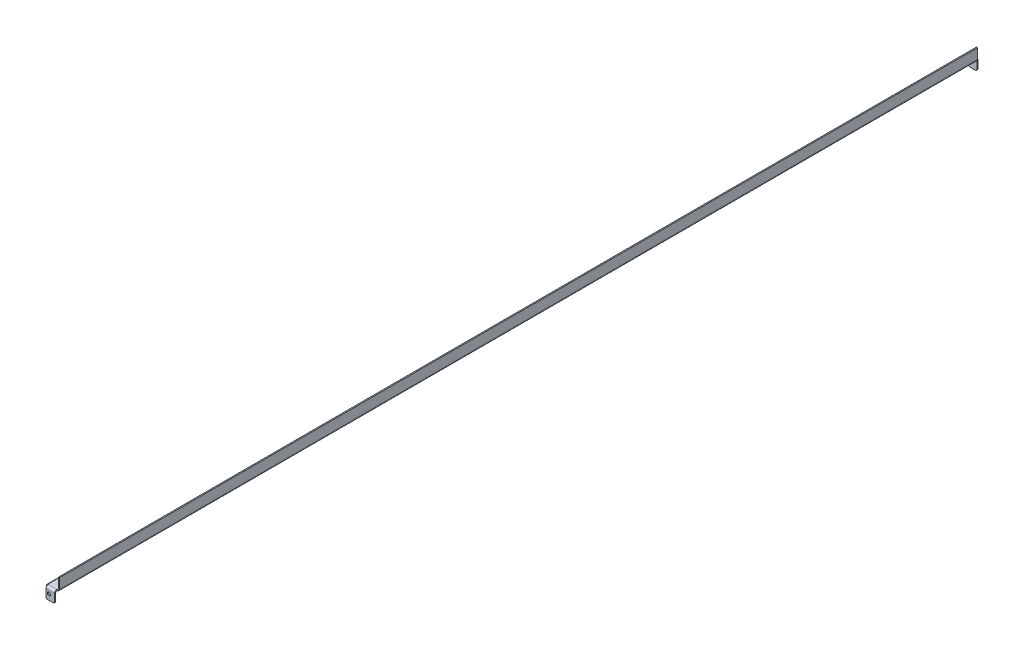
ISO-10303-21;
HEADER;
FILE_DESCRIPTION(('STEP AP214'),'2;1');
FILE_NAME('part.step','',(''),(''),'','','');
FILE_SCHEMA(('AUTOMOTIVE_DESIGN { 1 0 10303 214 1 1 1 1 }'));
ENDSEC;
DATA;
#1=APPLICATION_CONTEXT('core data for automotive mechanical design processes');
#2=APPLICATION_PROTOCOL_DEFINITION('international standard','automotive_design',2000,#1);
#3=PRODUCT_CONTEXT('',#1,'mechanical');
#4=PRODUCT('Part','Part','',(#3));
#5=PRODUCT_RELATED_PRODUCT_CATEGORY('part','',(#4));
#6=PRODUCT_DEFINITION_FORMATION('','',#4);
#7=PRODUCT_DEFINITION_CONTEXT('part definition',#1,'design');
#8=PRODUCT_DEFINITION('design','',#6,#7);
#9=PRODUCT_DEFINITION_SHAPE('','',#8);
#10=(LENGTH_UNIT() NAMED_UNIT(*) SI_UNIT(.MILLI.,.METRE.));
#11=(NAMED_UNIT(*) PLANE_ANGLE_UNIT() SI_UNIT($,.RADIAN.));
#12=(NAMED_UNIT(*) SI_UNIT($,.STERADIAN.) SOLID_ANGLE_UNIT());
#13=UNCERTAINTY_MEASURE_WITH_UNIT(LENGTH_MEASURE(1.E-05),#10,'distance_accuracy_value','');
#14=(GEOMETRIC_REPRESENTATION_CONTEXT(3) GLOBAL_UNCERTAINTY_ASSIGNED_CONTEXT((#13)) GLOBAL_UNIT_ASSIGNED_CONTEXT((#10,
#11,#12)) REPRESENTATION_CONTEXT('',''));
#15=CARTESIAN_POINT('',(0.,0.,0.));
#16=DIRECTION('',(0.,0.,1.));
#17=DIRECTION('',(1.,0.,0.));
#18=AXIS2_PLACEMENT_3D('',#15,#16,#17);
#19=CARTESIAN_POINT('',(6.,20.,2475.));
#20=DIRECTION('',(0.,0.,1.));
#21=DIRECTION('',(1.,0.,0.));
#22=AXIS2_PLACEMENT_3D('',#19,#20,#21);
#23=PLANE('',#22);
#24=DIRECTION('',(0.,-1.,0.));
#25=VECTOR('',#24,1.);
#26=CARTESIAN_POINT('',(6.,20.,2475.));
#27=LINE('',#26,#25);
#28=CARTESIAN_POINT('',(6.,20.,2475.));
#29=VERTEX_POINT('',#28);
#30=CARTESIAN_POINT('',(6.,17.,2475.));
#31=VERTEX_POINT('',#30);
#32=EDGE_CURVE('E502',#29,#31,#27,.T.);
#33=ORIENTED_EDGE('',*,*,#32,.F.);
#34=CARTESIAN_POINT('',(6.,14.,2475.));
#35=DIRECTION('',(0.,0.,1.));
#36=DIRECTION('',(1.,0.,0.));
#37=AXIS2_PLACEMENT_3D('',#34,#35,#36);
#38=CIRCLE('',#37,6.);
#39=CARTESIAN_POINT('',(0.,14.,2475.));
#40=VERTEX_POINT('',#39);
#41=EDGE_CURVE('E410',#40,#29,#38,.F.);
#42=ORIENTED_EDGE('',*,*,#41,.F.);
#43=DIRECTION('',(-1.,0.,0.));
#44=VECTOR('',#43,1.);
#45=CARTESIAN_POINT('',(3.,14.,2475.));
#46=LINE('',#45,#44);
#47=CARTESIAN_POINT('',(3.,14.,2475.));
#48=VERTEX_POINT('',#47);
#49=EDGE_CURVE('E500',#48,#40,#46,.T.);
#50=ORIENTED_EDGE('',*,*,#49,.F.);
#51=CARTESIAN_POINT('',(6.,14.,2475.));
#52=DIRECTION('',(0.,0.,1.));
#53=DIRECTION('',(1.,0.,0.));
#54=AXIS2_PLACEMENT_3D('',#51,#52,#53);
#55=CIRCLE('',#54,3.);
#56=EDGE_CURVE('E422',#48,#31,#55,.F.);
#57=ORIENTED_EDGE('',*,*,#56,.T.);
#58=EDGE_LOOP('',(#33,#42,#50,#57));
#59=FACE_BOUND('',#58,.T.);
#60=ADVANCED_FACE('F76',(#59),#23,.T.);
#61=CARTESIAN_POINT('',(0.,14.,0.));
#62=DIRECTION('',(0.,0.,-1.));
#63=DIRECTION('',(-1.,0.,0.));
#64=AXIS2_PLACEMENT_3D('',#61,#62,#63);
#65=PLANE('',#64);
#66=DIRECTION('',(1.,0.,0.));
#67=VECTOR('',#66,1.);
#68=CARTESIAN_POINT('',(0.,14.,0.));
#69=LINE('',#68,#67);
#70=CARTESIAN_POINT('',(0.,14.,0.));
#71=VERTEX_POINT('',#70);
#72=CARTESIAN_POINT('',(3.,14.,0.));
#73=VERTEX_POINT('',#72);
#74=EDGE_CURVE('E498',#71,#73,#69,.T.);
#75=ORIENTED_EDGE('',*,*,#74,.F.);
#76=CARTESIAN_POINT('',(6.,14.,0.));
#77=DIRECTION('',(0.,0.,1.));
#78=DIRECTION('',(1.,0.,0.));
#79=AXIS2_PLACEMENT_3D('',#76,#77,#78);
#80=CIRCLE('',#79,6.);
#81=CARTESIAN_POINT('',(6.,20.,0.));
#82=VERTEX_POINT('',#81);
#83=EDGE_CURVE('E439',#71,#82,#80,.F.);
#84=ORIENTED_EDGE('',*,*,#83,.T.);
#85=DIRECTION('',(0.,1.,0.));
#86=VECTOR('',#85,1.);
#87=CARTESIAN_POINT('',(6.,17.,0.));
#88=LINE('',#87,#86);
#89=CARTESIAN_POINT('',(6.,17.,0.));
#90=VERTEX_POINT('',#89);
#91=EDGE_CURVE('E495',#90,#82,#88,.T.);
#92=ORIENTED_EDGE('',*,*,#91,.F.);
#93=CARTESIAN_POINT('',(6.,14.,0.));
#94=DIRECTION('',(0.,0.,1.));
#95=DIRECTION('',(1.,0.,0.));
#96=AXIS2_PLACEMENT_3D('',#93,#94,#95);
#97=CIRCLE('',#96,3.);
#98=EDGE_CURVE('E450',#73,#90,#97,.F.);
#99=ORIENTED_EDGE('',*,*,#98,.F.);
#100=EDGE_LOOP('',(#75,#84,#92,#99));
#101=FACE_BOUND('',#100,.T.);
#102=ADVANCED_FACE('F634',(#101),#65,.T.);
#103=CARTESIAN_POINT('',(6.,17.,0.));
#104=DIRECTION('',(0.,0.,-1.));
#105=DIRECTION('',(-1.,0.,0.));
#106=AXIS2_PLACEMENT_3D('',#103,#104,#105);
#107=PLANE('',#106);
#108=DIRECTION('',(0.,1.,0.));
#109=VECTOR('',#108,1.);
#110=CARTESIAN_POINT('',(0.,0.,0.));
#111=LINE('',#110,#109);
#112=CARTESIAN_POINT('',(0.,0.,0.));
#113=VERTEX_POINT('',#112);
#114=EDGE_CURVE('E441',#113,#71,#111,.T.);
#115=ORIENTED_EDGE('',*,*,#114,.T.);
#116=ORIENTED_EDGE('',*,*,#74,.T.);
#117=DIRECTION('',(0.,1.,0.));
#118=VECTOR('',#117,1.);
#119=CARTESIAN_POINT('',(3.,0.,0.));
#120=LINE('',#119,#118);
#121=CARTESIAN_POINT('',(3.,0.,0.));
#122=VERTEX_POINT('',#121);
#123=EDGE_CURVE('E447',#122,#73,#120,.T.);
#124=ORIENTED_EDGE('',*,*,#123,.F.);
#125=DIRECTION('',(-1.,0.,0.));
#126=VECTOR('',#125,1.);
#127=CARTESIAN_POINT('',(3.,0.,0.));
#128=LINE('',#127,#126);
#129=EDGE_CURVE('E444',#122,#113,#128,.T.);
#130=ORIENTED_EDGE('',*,*,#129,.T.);
#131=EDGE_LOOP('',(#115,#116,#124,#130));
#132=FACE_BOUND('',#131,.T.);
#133=ADVANCED_FACE('F640',(#132),#107,.T.);
#134=CARTESIAN_POINT('',(32.22,23.,2475.));
#135=DIRECTION('',(0.,0.,1.));
#136=DIRECTION('',(1.,0.,0.));
#137=AXIS2_PLACEMENT_3D('',#134,#135,#136);
#138=PLANE('',#137);
#139=DIRECTION('',(1.,0.,0.));
#140=VECTOR('',#139,1.);
#141=CARTESIAN_POINT('',(32.22,23.,2475.));
#142=LINE('',#141,#140);
#143=CARTESIAN_POINT('',(32.22,23.,2475.));
#144=VERTEX_POINT('',#143);
#145=CARTESIAN_POINT('',(35.22,23.,2475.));
#146=VERTEX_POINT('',#145);
#147=EDGE_CURVE('E493',#144,#146,#142,.T.);
#148=ORIENTED_EDGE('',*,*,#147,.F.);
#149=CARTESIAN_POINT('',(29.22,23.,2475.));
#150=DIRECTION('',(0.,0.,-1.));
#151=DIRECTION('',(-1.,0.,0.));
#152=AXIS2_PLACEMENT_3D('',#149,#150,#151);
#153=CIRCLE('',#152,3.);
#154=CARTESIAN_POINT('',(29.22,19.9999999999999,2475.));
#155=VERTEX_POINT('',#154);
#156=EDGE_CURVE('E407',#155,#144,#153,.F.);
#157=ORIENTED_EDGE('',*,*,#156,.F.);
#158=DIRECTION('',(0.,1.,0.));
#159=VECTOR('',#158,1.);
#160=CARTESIAN_POINT('',(29.22,17.,2475.));
#161=LINE('',#160,#159);
#162=CARTESIAN_POINT('',(29.22,17.,2475.));
#163=VERTEX_POINT('',#162);
#164=EDGE_CURVE('E490',#163,#155,#161,.T.);
#165=ORIENTED_EDGE('',*,*,#164,.F.);
#166=CARTESIAN_POINT('',(29.22,23.,2475.));
#167=DIRECTION('',(0.,0.,1.));
#168=DIRECTION('',(1.,0.,0.));
#169=AXIS2_PLACEMENT_3D('',#166,#167,#168);
#170=CIRCLE('',#169,6.);
#171=EDGE_CURVE('E424',#163,#146,#170,.T.);
#172=ORIENTED_EDGE('',*,*,#171,.T.);
#173=EDGE_LOOP('',(#148,#157,#165,#172));
#174=FACE_BOUND('',#173,.T.);
#175=ADVANCED_FACE('F787',(#174),#138,.T.);
#176=CARTESIAN_POINT('',(29.22,17.,2475.));
#177=DIRECTION('',(0.,0.,1.));
#178=DIRECTION('',(1.,0.,0.));
#179=AXIS2_PLACEMENT_3D('',#176,#177,#178);
#180=PLANE('',#179);
#181=DIRECTION('',(0.,1.,0.));
#182=VECTOR('',#181,1.);
#183=CARTESIAN_POINT('',(32.22,20.,2475.));
#184=LINE('',#183,#182);
#185=CARTESIAN_POINT('',(32.22,50.,2475.));
#186=VERTEX_POINT('',#185);
#187=EDGE_CURVE('E404',#144,#186,#184,.T.);
#188=ORIENTED_EDGE('',*,*,#187,.F.);
#189=ORIENTED_EDGE('',*,*,#147,.T.);
#190=DIRECTION('',(0.,1.,0.));
#191=VECTOR('',#190,1.);
#192=CARTESIAN_POINT('',(35.22,20.,2475.));
#193=LINE('',#192,#191);
#194=CARTESIAN_POINT('',(35.22,50.,2475.));
#195=VERTEX_POINT('',#194);
#196=EDGE_CURVE('E398',#146,#195,#193,.T.);
#197=ORIENTED_EDGE('',*,*,#196,.T.);
#198=DIRECTION('',(1.,0.,0.));
#199=VECTOR('',#198,1.);
#200=CARTESIAN_POINT('',(32.22,50.,2475.));
#201=LINE('',#200,#199);
#202=EDGE_CURVE('E400',#186,#195,#201,.T.);
#203=ORIENTED_EDGE('',*,*,#202,.F.);
#204=EDGE_LOOP('',(#188,#189,#197,#203));
#205=FACE_BOUND('',#204,.T.);
#206=ADVANCED_FACE('F783',(#205),#180,.T.);
#207=CARTESIAN_POINT('',(29.22,20.,0.));
#208=DIRECTION('',(0.,0.,-1.));
#209=DIRECTION('',(-1.,0.,0.));
#210=AXIS2_PLACEMENT_3D('',#207,#208,#209);
#211=PLANE('',#210);
#212=DIRECTION('',(0.,-1.,0.));
#213=VECTOR('',#212,1.);
#214=CARTESIAN_POINT('',(29.22,20.,0.));
#215=LINE('',#214,#213);
#216=CARTESIAN_POINT('',(29.22,20.,0.));
#217=VERTEX_POINT('',#216);
#218=CARTESIAN_POINT('',(29.22,17.,0.));
#219=VERTEX_POINT('',#218);
#220=EDGE_CURVE('E487',#217,#219,#215,.T.);
#221=ORIENTED_EDGE('',*,*,#220,.F.);
#222=CARTESIAN_POINT('',(29.22,23.,0.));
#223=DIRECTION('',(0.,0.,-1.));
#224=DIRECTION('',(-1.,0.,0.));
#225=AXIS2_PLACEMENT_3D('',#222,#223,#224);
#226=CIRCLE('',#225,3.);
#227=CARTESIAN_POINT('',(32.22,23.,0.));
#228=VERTEX_POINT('',#227);
#229=EDGE_CURVE('E436',#217,#228,#226,.F.);
#230=ORIENTED_EDGE('',*,*,#229,.T.);
#231=DIRECTION('',(-1.,0.,0.));
#232=VECTOR('',#231,1.);
#233=CARTESIAN_POINT('',(35.22,23.,0.));
#234=LINE('',#233,#232);
#235=CARTESIAN_POINT('',(35.22,23.,0.));
#236=VERTEX_POINT('',#235);
#237=EDGE_CURVE('E485',#236,#228,#234,.T.);
#238=ORIENTED_EDGE('',*,*,#237,.F.);
#239=CARTESIAN_POINT('',(29.22,23.,0.));
#240=DIRECTION('',(0.,0.,1.));
#241=DIRECTION('',(1.,0.,0.));
#242=AXIS2_PLACEMENT_3D('',#239,#240,#241);
#243=CIRCLE('',#242,6.);
#244=EDGE_CURVE('E401',#219,#236,#243,.T.);
#245=ORIENTED_EDGE('',*,*,#244,.F.);
#246=EDGE_LOOP('',(#221,#230,#238,#245));
#247=FACE_BOUND('',#246,.T.);
#248=ADVANCED_FACE('F779',(#247),#211,.T.);
#249=CARTESIAN_POINT('',(35.22,20.,2475.));
#250=DIRECTION('',(-1.,0.,0.));
#251=DIRECTION('',(0.,0.,1.));
#252=AXIS2_PLACEMENT_3D('',#249,#250,#251);
#253=PLANE('',#252);
#254=DIRECTION('',(0.,1.,0.));
#255=VECTOR('',#254,1.);
#256=CARTESIAN_POINT('',(35.22,20.,0.));
#257=LINE('',#256,#255);
#258=CARTESIAN_POINT('',(35.22,50.,0.));
#259=VERTEX_POINT('',#258);
#260=EDGE_CURVE('E395',#236,#259,#257,.T.);
#261=ORIENTED_EDGE('',*,*,#260,.T.);
#262=DIRECTION('',(0.,0.,-1.));
#263=VECTOR('',#262,1.);
#264=CARTESIAN_POINT('',(35.22,50.,2475.));
#265=LINE('',#264,#263);
#266=EDGE_CURVE('E483',#195,#259,#265,.T.);
#267=ORIENTED_EDGE('',*,*,#266,.F.);
#268=ORIENTED_EDGE('',*,*,#196,.F.);
#269=DIRECTION('',(0.,0.,-1.));
#270=VECTOR('',#269,1.);
#271=CARTESIAN_POINT('',(35.22,23.,2475.));
#272=LINE('',#271,#270);
#273=EDGE_CURVE('E427',#146,#236,#272,.T.);
#274=ORIENTED_EDGE('',*,*,#273,.T.);
#275=EDGE_LOOP('',(#261,#267,#268,#274));
#276=FACE_BOUND('',#275,.T.);
#277=ADVANCED_FACE('F775',(#276),#253,.F.);
#278=CARTESIAN_POINT('',(32.22,50.,2475.));
#279=DIRECTION('',(0.,1.,0.));
#280=DIRECTION('',(0.,0.,1.));
#281=AXIS2_PLACEMENT_3D('',#278,#279,#280);
#282=PLANE('',#281);
#283=DIRECTION('',(1.,0.,0.));
#284=VECTOR('',#283,1.);
#285=CARTESIAN_POINT('',(32.22,50.,0.));
#286=LINE('',#285,#284);
#287=CARTESIAN_POINT('',(32.22,50.,0.));
#288=VERTEX_POINT('',#287);
#289=EDGE_CURVE('E430',#288,#259,#286,.T.);
#290=ORIENTED_EDGE('',*,*,#289,.F.);
#291=DIRECTION('',(0.,0.,-1.));
#292=VECTOR('',#291,1.);
#293=CARTESIAN_POINT('',(32.22,50.,2475.));
#294=LINE('',#293,#292);
#295=EDGE_CURVE('E481',#186,#288,#294,.T.);
#296=ORIENTED_EDGE('',*,*,#295,.F.);
#297=ORIENTED_EDGE('',*,*,#202,.T.);
#298=ORIENTED_EDGE('',*,*,#266,.T.);
#299=EDGE_LOOP('',(#290,#296,#297,#298));
#300=FACE_BOUND('',#299,.T.);
#301=ADVANCED_FACE('F771',(#300),#282,.T.);
#302=CARTESIAN_POINT('',(32.22,20.,2475.));
#303=DIRECTION('',(-1.,0.,0.));
#304=DIRECTION('',(0.,0.,1.));
#305=AXIS2_PLACEMENT_3D('',#302,#303,#304);
#306=PLANE('',#305);
#307=DIRECTION('',(0.,1.,0.));
#308=VECTOR('',#307,1.);
#309=CARTESIAN_POINT('',(32.22,20.,0.));
#310=LINE('',#309,#308);
#311=EDGE_CURVE('E433',#228,#288,#310,.T.);
#312=ORIENTED_EDGE('',*,*,#311,.F.);
#313=DIRECTION('',(0.,0.,-1.));
#314=VECTOR('',#313,1.);
#315=CARTESIAN_POINT('',(32.22,23.,2475.));
#316=LINE('',#315,#314);
#317=EDGE_CURVE('E478',#144,#228,#316,.T.);
#318=ORIENTED_EDGE('',*,*,#317,.F.);
#319=ORIENTED_EDGE('',*,*,#187,.T.);
#320=ORIENTED_EDGE('',*,*,#295,.T.);
#321=EDGE_LOOP('',(#312,#318,#319,#320));
#322=FACE_BOUND('',#321,.T.);
#323=ADVANCED_FACE('F767',(#322),#306,.T.);
#324=CARTESIAN_POINT('',(29.22,23.,2475.));
#325=DIRECTION('',(0.,0.,-1.));
#326=DIRECTION('',(-1.,0.,0.));
#327=AXIS2_PLACEMENT_3D('',#324,#325,#326);
#328=CYLINDRICAL_SURFACE('',#327,3.);
#329=ORIENTED_EDGE('',*,*,#229,.F.);
#330=DIRECTION('',(0.,0.,-1.));
#331=VECTOR('',#330,1.);
#332=CARTESIAN_POINT('',(29.22,20.,2475.));
#333=LINE('',#332,#331);
#334=EDGE_CURVE('E475',#155,#217,#333,.T.);
#335=ORIENTED_EDGE('',*,*,#334,.F.);
#336=ORIENTED_EDGE('',*,*,#156,.T.);
#337=ORIENTED_EDGE('',*,*,#317,.T.);
#338=EDGE_LOOP('',(#329,#335,#336,#337));
#339=FACE_BOUND('',#338,.T.);
#340=ADVANCED_FACE('F764',(#339),#328,.F.);
#341=CARTESIAN_POINT('',(0.,20.,2475.));
#342=DIRECTION('',(0.,1.,0.));
#343=DIRECTION('',(0.,0.,1.));
#344=AXIS2_PLACEMENT_3D('',#341,#342,#343);
#345=PLANE('',#344);
#346=ORIENTED_EDGE('',*,*,#334,.T.);
#347=DIRECTION('',(0.,0.,1.));
#348=VECTOR('',#347,1.);
#349=CARTESIAN_POINT('',(29.22,20.,-0.999999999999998));
#350=LINE('',#349,#348);
#351=CARTESIAN_POINT('',(29.22,20.,-0.999999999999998));
#352=VERTEX_POINT('',#351);
#353=EDGE_CURVE('E327',#352,#217,#350,.T.);
#354=ORIENTED_EDGE('',*,*,#353,.F.);
#355=DIRECTION('',(1.,0.,0.));
#356=VECTOR('',#355,1.);
#357=CARTESIAN_POINT('',(29.22,20.,-0.999999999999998));
#358=LINE('',#357,#356);
#359=CARTESIAN_POINT('',(6.,20.,-0.999999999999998));
#360=VERTEX_POINT('',#359);
#361=EDGE_CURVE('E270',#352,#360,#358,.F.);
#362=ORIENTED_EDGE('',*,*,#361,.T.);
#363=DIRECTION('',(0.,0.,1.));
#364=VECTOR('',#363,1.);
#365=CARTESIAN_POINT('',(6.,20.,-0.999999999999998));
#366=LINE('',#365,#364);
#367=EDGE_CURVE('E324',#360,#82,#366,.T.);
#368=ORIENTED_EDGE('',*,*,#367,.T.);
#369=DIRECTION('',(0.,0.,-1.));
#370=VECTOR('',#369,1.);
#371=CARTESIAN_POINT('',(6.,20.,2475.));
#372=LINE('',#371,#370);
#373=EDGE_CURVE('E472',#29,#82,#372,.T.);
#374=ORIENTED_EDGE('',*,*,#373,.F.);
#375=DIRECTION('',(0.,0.,-1.));
#376=VECTOR('',#375,1.);
#377=CARTESIAN_POINT('',(6.,19.9999999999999,2476.));
#378=LINE('',#377,#376);
#379=CARTESIAN_POINT('',(6.,19.9999999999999,2476.));
#380=VERTEX_POINT('',#379);
#381=EDGE_CURVE('E389',#380,#29,#378,.T.);
#382=ORIENTED_EDGE('',*,*,#381,.F.);
#383=DIRECTION('',(-1.,0.,0.));
#384=VECTOR('',#383,1.);
#385=CARTESIAN_POINT('',(6.,19.9999999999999,2476.));
#386=LINE('',#385,#384);
#387=CARTESIAN_POINT('',(29.22,19.9999999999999,2476.));
#388=VERTEX_POINT('',#387);
#389=EDGE_CURVE('E363',#380,#388,#386,.F.);
#390=ORIENTED_EDGE('',*,*,#389,.T.);
#391=DIRECTION('',(0.,0.,-1.));
#392=VECTOR('',#391,1.);
#393=CARTESIAN_POINT('',(29.22,19.9999999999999,2476.));
#394=LINE('',#393,#392);
#395=EDGE_CURVE('E386',#388,#155,#394,.T.);
#396=ORIENTED_EDGE('',*,*,#395,.T.);
#397=EDGE_LOOP('',(#346,#354,#362,#368,#374,#382,#390,#396));
#398=FACE_BOUND('',#397,.T.);
#399=ADVANCED_FACE('F567',(#398),#345,.T.);
#400=CARTESIAN_POINT('',(6.,14.,2475.));
#401=DIRECTION('',(0.,0.,-1.));
#402=DIRECTION('',(-1.,0.,0.));
#403=AXIS2_PLACEMENT_3D('',#400,#401,#402);
#404=CYLINDRICAL_SURFACE('',#403,6.);
#405=ORIENTED_EDGE('',*,*,#83,.F.);
#406=DIRECTION('',(0.,0.,-1.));
#407=VECTOR('',#406,1.);
#408=CARTESIAN_POINT('',(0.,14.,2475.));
#409=LINE('',#408,#407);
#410=EDGE_CURVE('E469',#40,#71,#409,.T.);
#411=ORIENTED_EDGE('',*,*,#410,.F.);
#412=ORIENTED_EDGE('',*,*,#41,.T.);
#413=ORIENTED_EDGE('',*,*,#373,.T.);
#414=EDGE_LOOP('',(#405,#411,#412,#413));
#415=FACE_BOUND('',#414,.T.);
#416=ADVANCED_FACE('F757',(#415),#404,.T.);
#417=CARTESIAN_POINT('',(0.,0.,2475.));
#418=DIRECTION('',(-1.,0.,0.));
#419=DIRECTION('',(0.,0.,1.));
#420=AXIS2_PLACEMENT_3D('',#417,#418,#419);
#421=PLANE('',#420);
#422=ORIENTED_EDGE('',*,*,#114,.F.);
#423=DIRECTION('',(0.,0.,-1.));
#424=VECTOR('',#423,1.);
#425=CARTESIAN_POINT('',(0.,0.,2475.));
#426=LINE('',#425,#424);
#427=CARTESIAN_POINT('',(0.,0.,2475.));
#428=VERTEX_POINT('',#427);
#429=EDGE_CURVE('E467',#428,#113,#426,.T.);
#430=ORIENTED_EDGE('',*,*,#429,.F.);
#431=DIRECTION('',(0.,1.,0.));
#432=VECTOR('',#431,1.);
#433=CARTESIAN_POINT('',(0.,0.,2475.));
#434=LINE('',#433,#432);
#435=EDGE_CURVE('E413',#428,#40,#434,.T.);
#436=ORIENTED_EDGE('',*,*,#435,.T.);
#437=ORIENTED_EDGE('',*,*,#410,.T.);
#438=EDGE_LOOP('',(#422,#430,#436,#437));
#439=FACE_BOUND('',#438,.T.);
#440=ADVANCED_FACE('F753',(#439),#421,.T.);
#441=CARTESIAN_POINT('',(3.,0.,2475.));
#442=DIRECTION('',(0.,-1.,0.));
#443=DIRECTION('',(0.,0.,-1.));
#444=AXIS2_PLACEMENT_3D('',#441,#442,#443);
#445=PLANE('',#444);
#446=ORIENTED_EDGE('',*,*,#129,.F.);
#447=DIRECTION('',(0.,0.,-1.));
#448=VECTOR('',#447,1.);
#449=CARTESIAN_POINT('',(3.,0.,2475.));
#450=LINE('',#449,#448);
#451=CARTESIAN_POINT('',(3.,0.,2475.));
#452=VERTEX_POINT('',#451);
#453=EDGE_CURVE('E465',#452,#122,#450,.T.);
#454=ORIENTED_EDGE('',*,*,#453,.F.);
#455=DIRECTION('',(-1.,0.,0.));
#456=VECTOR('',#455,1.);
#457=CARTESIAN_POINT('',(3.,0.,2475.));
#458=LINE('',#457,#456);
#459=EDGE_CURVE('E416',#452,#428,#458,.T.);
#460=ORIENTED_EDGE('',*,*,#459,.T.);
#461=ORIENTED_EDGE('',*,*,#429,.T.);
#462=EDGE_LOOP('',(#446,#454,#460,#461));
#463=FACE_BOUND('',#462,.T.);
#464=ADVANCED_FACE('F749',(#463),#445,.T.);
#465=CARTESIAN_POINT('',(3.,0.,2475.));
#466=DIRECTION('',(-1.,0.,0.));
#467=DIRECTION('',(0.,0.,1.));
#468=AXIS2_PLACEMENT_3D('',#465,#466,#467);
#469=PLANE('',#468);
#470=ORIENTED_EDGE('',*,*,#123,.T.);
#471=DIRECTION('',(0.,0.,-1.));
#472=VECTOR('',#471,1.);
#473=CARTESIAN_POINT('',(3.,14.,2475.));
#474=LINE('',#473,#472);
#475=EDGE_CURVE('E462',#48,#73,#474,.T.);
#476=ORIENTED_EDGE('',*,*,#475,.F.);
#477=DIRECTION('',(0.,1.,0.));
#478=VECTOR('',#477,1.);
#479=CARTESIAN_POINT('',(3.,0.,2475.));
#480=LINE('',#479,#478);
#481=EDGE_CURVE('E419',#452,#48,#480,.T.);
#482=ORIENTED_EDGE('',*,*,#481,.F.);
#483=ORIENTED_EDGE('',*,*,#453,.T.);
#484=EDGE_LOOP('',(#470,#476,#482,#483));
#485=FACE_BOUND('',#484,.T.);
#486=ADVANCED_FACE('F745',(#485),#469,.F.);
#487=CARTESIAN_POINT('',(6.,14.,2475.));
#488=DIRECTION('',(0.,0.,-1.));
#489=DIRECTION('',(-1.,0.,0.));
#490=AXIS2_PLACEMENT_3D('',#487,#488,#489);
#491=CYLINDRICAL_SURFACE('',#490,3.);
#492=ORIENTED_EDGE('',*,*,#98,.T.);
#493=DIRECTION('',(0.,0.,-1.));
#494=VECTOR('',#493,1.);
#495=CARTESIAN_POINT('',(6.,17.,2475.));
#496=LINE('',#495,#494);
#497=EDGE_CURVE('E459',#31,#90,#496,.T.);
#498=ORIENTED_EDGE('',*,*,#497,.F.);
#499=ORIENTED_EDGE('',*,*,#56,.F.);
#500=ORIENTED_EDGE('',*,*,#475,.T.);
#501=EDGE_LOOP('',(#492,#498,#499,#500));
#502=FACE_BOUND('',#501,.T.);
#503=ADVANCED_FACE('F742',(#502),#491,.F.);
#504=CARTESIAN_POINT('',(0.,17.,2475.));
#505=DIRECTION('',(0.,1.,0.));
#506=DIRECTION('',(0.,0.,1.));
#507=AXIS2_PLACEMENT_3D('',#504,#505,#506);
#508=PLANE('',#507);
#509=ORIENTED_EDGE('',*,*,#497,.T.);
#510=DIRECTION('',(0.,0.,1.));
#511=VECTOR('',#510,1.);
#512=CARTESIAN_POINT('',(6.,17.,-0.999999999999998));
#513=LINE('',#512,#511);
#514=CARTESIAN_POINT('',(6.,17.,-0.999999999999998));
#515=VERTEX_POINT('',#514);
#516=EDGE_CURVE('E321',#515,#90,#513,.T.);
#517=ORIENTED_EDGE('',*,*,#516,.F.);
#518=DIRECTION('',(1.,0.,0.));
#519=VECTOR('',#518,1.);
#520=CARTESIAN_POINT('',(29.22,17.,-0.999999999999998));
#521=LINE('',#520,#519);
#522=CARTESIAN_POINT('',(29.22,17.,-0.999999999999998));
#523=VERTEX_POINT('',#522);
#524=EDGE_CURVE('E315',#523,#515,#521,.F.);
#525=ORIENTED_EDGE('',*,*,#524,.F.);
#526=DIRECTION('',(0.,0.,1.));
#527=VECTOR('',#526,1.);
#528=CARTESIAN_POINT('',(29.22,17.,-0.999999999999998));
#529=LINE('',#528,#527);
#530=EDGE_CURVE('E330',#523,#219,#529,.T.);
#531=ORIENTED_EDGE('',*,*,#530,.T.);
#532=DIRECTION('',(0.,0.,-1.));
#533=VECTOR('',#532,1.);
#534=CARTESIAN_POINT('',(29.22,17.,2475.));
#535=LINE('',#534,#533);
#536=EDGE_CURVE('E457',#163,#219,#535,.T.);
#537=ORIENTED_EDGE('',*,*,#536,.F.);
#538=DIRECTION('',(0.,0.,-1.));
#539=VECTOR('',#538,1.);
#540=CARTESIAN_POINT('',(29.22,16.9999999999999,2476.));
#541=LINE('',#540,#539);
#542=CARTESIAN_POINT('',(29.22,16.9999999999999,2476.));
#543=VERTEX_POINT('',#542);
#544=EDGE_CURVE('E383',#543,#163,#541,.T.);
#545=ORIENTED_EDGE('',*,*,#544,.F.);
#546=DIRECTION('',(-1.,0.,0.));
#547=VECTOR('',#546,1.);
#548=CARTESIAN_POINT('',(6.,16.9999999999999,2476.));
#549=LINE('',#548,#547);
#550=CARTESIAN_POINT('',(6.,16.9999999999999,2476.));
#551=VERTEX_POINT('',#550);
#552=EDGE_CURVE('E376',#551,#543,#549,.F.);
#553=ORIENTED_EDGE('',*,*,#552,.F.);
#554=DIRECTION('',(0.,0.,-1.));
#555=VECTOR('',#554,1.);
#556=CARTESIAN_POINT('',(6.,16.9999999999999,2476.));
#557=LINE('',#556,#555);
#558=EDGE_CURVE('E392',#551,#31,#557,.T.);
#559=ORIENTED_EDGE('',*,*,#558,.T.);
#560=EDGE_LOOP('',(#509,#517,#525,#531,#537,#545,#553,#559));
#561=FACE_BOUND('',#560,.T.);
#562=ADVANCED_FACE('F561',(#561),#508,.F.);
#563=CARTESIAN_POINT('',(29.22,23.,2475.));
#564=DIRECTION('',(0.,0.,-1.));
#565=DIRECTION('',(-1.,0.,0.));
#566=AXIS2_PLACEMENT_3D('',#563,#564,#565);
#567=CYLINDRICAL_SURFACE('',#566,6.);
#568=ORIENTED_EDGE('',*,*,#244,.T.);
#569=ORIENTED_EDGE('',*,*,#273,.F.);
#570=ORIENTED_EDGE('',*,*,#171,.F.);
#571=ORIENTED_EDGE('',*,*,#536,.T.);
#572=EDGE_LOOP('',(#568,#569,#570,#571));
#573=FACE_BOUND('',#572,.T.);
#574=ADVANCED_FACE('F580',(#573),#567,.T.);
#575=CARTESIAN_POINT('',(29.22,23.,2475.));
#576=DIRECTION('',(0.,0.,-1.));
#577=DIRECTION('',(-1.,0.,0.));
#578=AXIS2_PLACEMENT_3D('',#575,#576,#577);
#579=PLANE('',#578);
#580=ORIENTED_EDGE('',*,*,#481,.T.);
#581=ORIENTED_EDGE('',*,*,#49,.T.);
#582=ORIENTED_EDGE('',*,*,#435,.F.);
#583=ORIENTED_EDGE('',*,*,#459,.F.);
#584=EDGE_LOOP('',(#580,#581,#582,#583));
#585=FACE_BOUND('',#584,.T.);
#586=ADVANCED_FACE('F731',(#585),#579,.F.);
#587=CARTESIAN_POINT('',(29.22,23.,0.));
#588=DIRECTION('',(0.,0.,-1.));
#589=DIRECTION('',(-1.,0.,0.));
#590=AXIS2_PLACEMENT_3D('',#587,#588,#589);
#591=PLANE('',#590);
#592=ORIENTED_EDGE('',*,*,#260,.F.);
#593=ORIENTED_EDGE('',*,*,#237,.T.);
#594=ORIENTED_EDGE('',*,*,#311,.T.);
#595=ORIENTED_EDGE('',*,*,#289,.T.);
#596=EDGE_LOOP('',(#592,#593,#594,#595));
#597=FACE_BOUND('',#596,.T.);
#598=ADVANCED_FACE('F729',(#597),#591,.T.);
#599=CARTESIAN_POINT('',(6.,16.9999999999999,2476.));
#600=DIRECTION('',(-1.,0.,0.));
#601=DIRECTION('',(0.,1.,0.));
#602=AXIS2_PLACEMENT_3D('',#599,#600,#601);
#603=PLANE('',#602);
#604=ORIENTED_EDGE('',*,*,#558,.F.);
#605=DIRECTION('',(0.,1.,0.));
#606=VECTOR('',#605,1.);
#607=CARTESIAN_POINT('',(6.,16.9999999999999,2476.));
#608=LINE('',#607,#606);
#609=EDGE_CURVE('E370',#551,#380,#608,.T.);
#610=ORIENTED_EDGE('',*,*,#609,.T.);
#611=ORIENTED_EDGE('',*,*,#381,.T.);
#612=ORIENTED_EDGE('',*,*,#32,.T.);
#613=EDGE_LOOP('',(#604,#610,#611,#612));
#614=FACE_BOUND('',#613,.T.);
#615=ADVANCED_FACE('F726',(#614),#603,.T.);
#616=CARTESIAN_POINT('',(29.22,16.9999999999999,2476.));
#617=DIRECTION('',(-1.,0.,0.));
#618=DIRECTION('',(0.,1.,0.));
#619=AXIS2_PLACEMENT_3D('',#616,#617,#618);
#620=PLANE('',#619);
#621=ORIENTED_EDGE('',*,*,#395,.F.);
#622=DIRECTION('',(0.,1.,0.));
#623=VECTOR('',#622,1.);
#624=CARTESIAN_POINT('',(29.22,16.9999999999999,2476.));
#625=LINE('',#624,#623);
#626=EDGE_CURVE('E380',#543,#388,#625,.T.);
#627=ORIENTED_EDGE('',*,*,#626,.F.);
#628=ORIENTED_EDGE('',*,*,#544,.T.);
#629=ORIENTED_EDGE('',*,*,#164,.T.);
#630=EDGE_LOOP('',(#621,#627,#628,#629));
#631=FACE_BOUND('',#630,.T.);
#632=ADVANCED_FACE('F585',(#631),#620,.F.);
#633=CARTESIAN_POINT('',(29.22,13.9999999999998,2476.));
#634=DIRECTION('',(1.,0.,0.));
#635=DIRECTION('',(0.,0.,-1.));
#636=AXIS2_PLACEMENT_3D('',#633,#634,#635);
#637=PLANE('',#636);
#638=DIRECTION('',(0.,0.,-1.));
#639=VECTOR('',#638,1.);
#640=CARTESIAN_POINT('',(29.22,13.9999999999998,2482.));
#641=LINE('',#640,#639);
#642=CARTESIAN_POINT('',(29.22,13.9999999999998,2479.));
#643=VERTEX_POINT('',#642);
#644=CARTESIAN_POINT('',(29.22,13.9999999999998,2482.));
#645=VERTEX_POINT('',#644);
#646=EDGE_CURVE('E333',#643,#645,#641,.F.);
#647=ORIENTED_EDGE('',*,*,#646,.F.);
#648=CARTESIAN_POINT('',(29.22,13.9999999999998,2476.));
#649=DIRECTION('',(-1.,0.,0.));
#650=DIRECTION('',(0.,0.,1.));
#651=AXIS2_PLACEMENT_3D('',#648,#649,#650);
#652=CIRCLE('',#651,3.00000000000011);
#653=EDGE_CURVE('E373',#543,#643,#652,.F.);
#654=ORIENTED_EDGE('',*,*,#653,.F.);
#655=ORIENTED_EDGE('',*,*,#626,.T.);
#656=CARTESIAN_POINT('',(29.22,13.9999999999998,2476.));
#657=DIRECTION('',(-1.,0.,0.));
#658=DIRECTION('',(0.,0.,1.));
#659=AXIS2_PLACEMENT_3D('',#656,#657,#658);
#660=CIRCLE('',#659,6.00000000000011);
#661=EDGE_CURVE('E366',#388,#645,#660,.F.);
#662=ORIENTED_EDGE('',*,*,#661,.T.);
#663=EDGE_LOOP('',(#647,#654,#655,#662));
#664=FACE_BOUND('',#663,.T.);
#665=ADVANCED_FACE('F589',(#664),#637,.T.);
#666=CARTESIAN_POINT('',(6.,13.9999999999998,2476.));
#667=DIRECTION('',(1.,0.,0.));
#668=DIRECTION('',(0.,0.,-1.));
#669=AXIS2_PLACEMENT_3D('',#666,#667,#668);
#670=PLANE('',#669);
#671=CARTESIAN_POINT('',(6.,13.9999999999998,2476.));
#672=DIRECTION('',(-1.,0.,0.));
#673=DIRECTION('',(0.,0.,1.));
#674=AXIS2_PLACEMENT_3D('',#671,#672,#673);
#675=CIRCLE('',#674,3.00000000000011);
#676=CARTESIAN_POINT('',(6.,13.9999999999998,2479.));
#677=VERTEX_POINT('',#676);
#678=EDGE_CURVE('E338',#677,#551,#675,.T.);
#679=ORIENTED_EDGE('',*,*,#678,.F.);
#680=DIRECTION('',(0.,0.,-1.));
#681=VECTOR('',#680,1.);
#682=CARTESIAN_POINT('',(6.,13.9999999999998,2479.));
#683=LINE('',#682,#681);
#684=CARTESIAN_POINT('',(6.,13.9999999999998,2482.));
#685=VERTEX_POINT('',#684);
#686=EDGE_CURVE('E356',#677,#685,#683,.F.);
#687=ORIENTED_EDGE('',*,*,#686,.T.);
#688=CARTESIAN_POINT('',(6.,13.9999999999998,2476.));
#689=DIRECTION('',(-1.,0.,0.));
#690=DIRECTION('',(0.,0.,1.));
#691=AXIS2_PLACEMENT_3D('',#688,#689,#690);
#692=CIRCLE('',#691,6.00000000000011);
#693=EDGE_CURVE('E367',#685,#380,#692,.T.);
#694=ORIENTED_EDGE('',*,*,#693,.T.);
#695=ORIENTED_EDGE('',*,*,#609,.F.);
#696=EDGE_LOOP('',(#679,#687,#694,#695));
#697=FACE_BOUND('',#696,.T.);
#698=ADVANCED_FACE('F715',(#697),#670,.F.);
#699=CARTESIAN_POINT('',(6.,13.9999999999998,2476.));
#700=DIRECTION('',(-1.,0.,0.));
#701=DIRECTION('',(0.,0.,1.));
#702=AXIS2_PLACEMENT_3D('',#699,#700,#701);
#703=CYLINDRICAL_SURFACE('',#702,6.00000000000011);
#704=ORIENTED_EDGE('',*,*,#389,.F.);
#705=ORIENTED_EDGE('',*,*,#693,.F.);
#706=DIRECTION('',(-1.,0.,0.));
#707=VECTOR('',#706,1.);
#708=CARTESIAN_POINT('',(29.22,13.9999999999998,2482.));
#709=LINE('',#708,#707);
#710=EDGE_CURVE('E353',#685,#645,#709,.F.);
#711=ORIENTED_EDGE('',*,*,#710,.T.);
#712=ORIENTED_EDGE('',*,*,#661,.F.);
#713=EDGE_LOOP('',(#704,#705,#711,#712));
#714=FACE_BOUND('',#713,.T.);
#715=ADVANCED_FACE('F712',(#714),#703,.T.);
#716=CARTESIAN_POINT('',(6.,13.9999999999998,2476.));
#717=DIRECTION('',(-1.,0.,0.));
#718=DIRECTION('',(0.,0.,1.));
#719=AXIS2_PLACEMENT_3D('',#716,#717,#718);
#720=CYLINDRICAL_SURFACE('',#719,3.00000000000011);
#721=ORIENTED_EDGE('',*,*,#552,.T.);
#722=ORIENTED_EDGE('',*,*,#653,.T.);
#723=DIRECTION('',(-1.,0.,0.));
#724=VECTOR('',#723,1.);
#725=CARTESIAN_POINT('',(29.22,13.9999999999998,2479.));
#726=LINE('',#725,#724);
#727=EDGE_CURVE('E359',#643,#677,#726,.T.);
#728=ORIENTED_EDGE('',*,*,#727,.T.);
#729=ORIENTED_EDGE('',*,*,#678,.T.);
#730=EDGE_LOOP('',(#721,#722,#728,#729));
#731=FACE_BOUND('',#730,.T.);
#732=ADVANCED_FACE('F592',(#731),#720,.F.);
#733=CARTESIAN_POINT('',(6.,-10.,2482.));
#734=DIRECTION('',(1.,0.,0.));
#735=DIRECTION('',(0.,0.,-1.));
#736=AXIS2_PLACEMENT_3D('',#733,#734,#735);
#737=PLANE('',#736);
#738=DIRECTION('',(0.,1.,0.));
#739=VECTOR('',#738,1.);
#740=CARTESIAN_POINT('',(6.,-10.,2479.));
#741=LINE('',#740,#739);
#742=CARTESIAN_POINT('',(6.,-6.00000000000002,2479.));
#743=VERTEX_POINT('',#742);
#744=EDGE_CURVE('E350',#677,#743,#741,.F.);
#745=ORIENTED_EDGE('',*,*,#744,.T.);
#746=DIRECTION('',(0.,0.,-1.));
#747=VECTOR('',#746,1.);
#748=CARTESIAN_POINT('',(6.,-6.00000000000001,2482.));
#749=LINE('',#748,#747);
#750=CARTESIAN_POINT('',(6.,-6.00000000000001,2482.));
#751=VERTEX_POINT('',#750);
#752=EDGE_CURVE('E514',#743,#751,#749,.F.);
#753=ORIENTED_EDGE('',*,*,#752,.T.);
#754=DIRECTION('',(0.,-1.,0.));
#755=VECTOR('',#754,1.);
#756=CARTESIAN_POINT('',(6.,0.,2482.));
#757=LINE('',#756,#755);
#758=EDGE_CURVE('E342',#685,#751,#757,.T.);
#759=ORIENTED_EDGE('',*,*,#758,.F.);
#760=ORIENTED_EDGE('',*,*,#686,.F.);
#761=EDGE_LOOP('',(#745,#753,#759,#760));
#762=FACE_BOUND('',#761,.T.);
#763=ADVANCED_FACE('F602',(#762),#737,.F.);
#764=CARTESIAN_POINT('',(29.22,17.,2482.));
#765=DIRECTION('',(-1.,0.,0.));
#766=DIRECTION('',(0.,0.,1.));
#767=AXIS2_PLACEMENT_3D('',#764,#765,#766);
#768=PLANE('',#767);
#769=DIRECTION('',(0.,1.,0.));
#770=VECTOR('',#769,1.);
#771=CARTESIAN_POINT('',(29.22,0.,2482.));
#772=LINE('',#771,#770);
#773=CARTESIAN_POINT('',(29.22,-6.00000000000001,2482.));
#774=VERTEX_POINT('',#773);
#775=EDGE_CURVE('E336',#774,#645,#772,.T.);
#776=ORIENTED_EDGE('',*,*,#775,.F.);
#777=DIRECTION('',(0.,0.,-1.));
#778=VECTOR('',#777,1.);
#779=CARTESIAN_POINT('',(29.22,-6.00000000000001,2482.));
#780=LINE('',#779,#778);
#781=CARTESIAN_POINT('',(29.22,-6.00000000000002,2479.));
#782=VERTEX_POINT('',#781);
#783=EDGE_CURVE('E520',#774,#782,#780,.T.);
#784=ORIENTED_EDGE('',*,*,#783,.T.);
#785=DIRECTION('',(0.,-1.,0.));
#786=VECTOR('',#785,1.);
#787=CARTESIAN_POINT('',(29.22,17.,2479.));
#788=LINE('',#787,#786);
#789=EDGE_CURVE('E345',#782,#643,#788,.F.);
#790=ORIENTED_EDGE('',*,*,#789,.T.);
#791=ORIENTED_EDGE('',*,*,#646,.T.);
#792=EDGE_LOOP('',(#776,#784,#790,#791));
#793=FACE_BOUND('',#792,.T.);
#794=ADVANCED_FACE('F621',(#793),#768,.F.);
#795=CARTESIAN_POINT('',(0.,0.,2482.));
#796=DIRECTION('',(0.,0.,-1.));
#797=DIRECTION('',(-1.,0.,0.));
#798=AXIS2_PLACEMENT_3D('',#795,#796,#797);
#799=PLANE('',#798);
#800=CARTESIAN_POINT('',(14.22,4.99999999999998,2482.));
#801=DIRECTION('',(0.,0.,-1.));
#802=DIRECTION('',(-1.,0.,0.));
#803=AXIS2_PLACEMENT_3D('',#800,#801,#802);
#804=CIRCLE('',#803,4.25);
#805=CARTESIAN_POINT('',(9.97,4.99999999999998,2482.));
#806=VERTEX_POINT('',#805);
#807=EDGE_CURVE('E699',#806,#806,#804,.T.);
#808=ORIENTED_EDGE('',*,*,#807,.T.);
#809=EDGE_LOOP('',(#808));
#810=FACE_BOUND('',#809,.T.);
#811=ORIENTED_EDGE('',*,*,#758,.T.);
#812=CARTESIAN_POINT('',(10.,-6.00000000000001,2482.));
#813=DIRECTION('',(0.,0.,-1.));
#814=DIRECTION('',(-1.,0.,0.));
#815=AXIS2_PLACEMENT_3D('',#812,#813,#814);
#816=CIRCLE('',#815,4.);
#817=CARTESIAN_POINT('',(10.,-10.,2482.));
#818=VERTEX_POINT('',#817);
#819=EDGE_CURVE('E518',#751,#818,#816,.F.);
#820=ORIENTED_EDGE('',*,*,#819,.T.);
#821=DIRECTION('',(1.,0.,0.));
#822=VECTOR('',#821,1.);
#823=CARTESIAN_POINT('',(0.,-10.,2482.));
#824=LINE('',#823,#822);
#825=CARTESIAN_POINT('',(25.22,-10.,2482.));
#826=VERTEX_POINT('',#825);
#827=EDGE_CURVE('E339',#818,#826,#824,.T.);
#828=ORIENTED_EDGE('',*,*,#827,.T.);
#829=CARTESIAN_POINT('',(25.22,-6.00000000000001,2482.));
#830=DIRECTION('',(0.,0.,-1.));
#831=DIRECTION('',(-1.,0.,0.));
#832=AXIS2_PLACEMENT_3D('',#829,#830,#831);
#833=CIRCLE('',#832,4.);
#834=EDGE_CURVE('E516',#826,#774,#833,.F.);
#835=ORIENTED_EDGE('',*,*,#834,.T.);
#836=ORIENTED_EDGE('',*,*,#775,.T.);
#837=ORIENTED_EDGE('',*,*,#710,.F.);
#838=EDGE_LOOP('',(#811,#820,#828,#835,#836,#837));
#839=FACE_BOUND('',#838,.T.);
#840=ADVANCED_FACE('F610',(#810,#839),#799,.F.);
#841=CARTESIAN_POINT('',(0.,0.,2479.));
#842=DIRECTION('',(0.,0.,-1.));
#843=DIRECTION('',(-1.,0.,0.));
#844=AXIS2_PLACEMENT_3D('',#841,#842,#843);
#845=PLANE('',#844);
#846=CARTESIAN_POINT('',(14.22,4.99999999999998,2479.));
#847=DIRECTION('',(0.,0.,-1.));
#848=DIRECTION('',(-1.,0.,0.));
#849=AXIS2_PLACEMENT_3D('',#846,#847,#848);
#850=CIRCLE('',#849,4.25);
#851=CARTESIAN_POINT('',(9.97,4.99999999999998,2479.));
#852=VERTEX_POINT('',#851);
#853=EDGE_CURVE('E697',#852,#852,#850,.T.);
#854=ORIENTED_EDGE('',*,*,#853,.F.);
#855=EDGE_LOOP('',(#854));
#856=FACE_BOUND('',#855,.T.);
#857=DIRECTION('',(-1.,0.,0.));
#858=VECTOR('',#857,1.);
#859=CARTESIAN_POINT('',(29.22,-10.,2479.));
#860=LINE('',#859,#858);
#861=CARTESIAN_POINT('',(10.,-10.,2479.));
#862=VERTEX_POINT('',#861);
#863=CARTESIAN_POINT('',(25.22,-10.,2479.));
#864=VERTEX_POINT('',#863);
#865=EDGE_CURVE('E347',#862,#864,#860,.F.);
#866=ORIENTED_EDGE('',*,*,#865,.F.);
#867=CARTESIAN_POINT('',(10.,-6.00000000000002,2479.));
#868=DIRECTION('',(0.,0.,-1.));
#869=DIRECTION('',(-1.,0.,0.));
#870=AXIS2_PLACEMENT_3D('',#867,#868,#869);
#871=CIRCLE('',#870,4.);
#872=EDGE_CURVE('E512',#862,#743,#871,.T.);
#873=ORIENTED_EDGE('',*,*,#872,.T.);
#874=ORIENTED_EDGE('',*,*,#744,.F.);
#875=ORIENTED_EDGE('',*,*,#727,.F.);
#876=ORIENTED_EDGE('',*,*,#789,.F.);
#877=CARTESIAN_POINT('',(25.22,-6.00000000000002,2479.));
#878=DIRECTION('',(0.,0.,-1.));
#879=DIRECTION('',(-1.,0.,0.));
#880=AXIS2_PLACEMENT_3D('',#877,#878,#879);
#881=CIRCLE('',#880,4.);
#882=EDGE_CURVE('E510',#782,#864,#881,.T.);
#883=ORIENTED_EDGE('',*,*,#882,.T.);
#884=EDGE_LOOP('',(#866,#873,#874,#875,#876,#883));
#885=FACE_BOUND('',#884,.T.);
#886=ADVANCED_FACE('F598',(#856,#885),#845,.T.);
#887=CARTESIAN_POINT('',(29.22,-10.,2482.));
#888=DIRECTION('',(0.,1.,0.));
#889=DIRECTION('',(0.,0.,1.));
#890=AXIS2_PLACEMENT_3D('',#887,#888,#889);
#891=PLANE('',#890);
#892=ORIENTED_EDGE('',*,*,#827,.F.);
#893=DIRECTION('',(0.,0.,-1.));
#894=VECTOR('',#893,1.);
#895=CARTESIAN_POINT('',(10.,-10.,2482.));
#896=LINE('',#895,#894);
#897=EDGE_CURVE('E507',#818,#862,#896,.T.);
#898=ORIENTED_EDGE('',*,*,#897,.T.);
#899=ORIENTED_EDGE('',*,*,#865,.T.);
#900=DIRECTION('',(0.,0.,-1.));
#901=VECTOR('',#900,1.);
#902=CARTESIAN_POINT('',(25.22,-10.,2482.));
#903=LINE('',#902,#901);
#904=EDGE_CURVE('E505',#864,#826,#903,.F.);
#905=ORIENTED_EDGE('',*,*,#904,.T.);
#906=EDGE_LOOP('',(#892,#898,#899,#905));
#907=FACE_BOUND('',#906,.T.);
#908=ADVANCED_FACE('F614',(#907),#891,.F.);
#909=CARTESIAN_POINT('',(29.22,17.,-0.999999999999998));
#910=DIRECTION('',(1.,0.,0.));
#911=DIRECTION('',(0.,1.,0.));
#912=AXIS2_PLACEMENT_3D('',#909,#910,#911);
#913=PLANE('',#912);
#914=ORIENTED_EDGE('',*,*,#530,.F.);
#915=DIRECTION('',(0.,1.,0.));
#916=VECTOR('',#915,1.);
#917=CARTESIAN_POINT('',(29.22,17.,-0.999999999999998));
#918=LINE('',#917,#916);
#919=EDGE_CURVE('E311',#523,#352,#918,.T.);
#920=ORIENTED_EDGE('',*,*,#919,.T.);
#921=ORIENTED_EDGE('',*,*,#353,.T.);
#922=ORIENTED_EDGE('',*,*,#220,.T.);
#923=EDGE_LOOP('',(#914,#920,#921,#922));
#924=FACE_BOUND('',#923,.T.);
#925=ADVANCED_FACE('F571',(#924),#913,.T.);
#926=CARTESIAN_POINT('',(6.,17.,-0.999999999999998));
#927=DIRECTION('',(1.,0.,0.));
#928=DIRECTION('',(0.,1.,0.));
#929=AXIS2_PLACEMENT_3D('',#926,#927,#928);
#930=PLANE('',#929);
#931=ORIENTED_EDGE('',*,*,#367,.F.);
#932=DIRECTION('',(0.,1.,0.));
#933=VECTOR('',#932,1.);
#934=CARTESIAN_POINT('',(6.,17.,-0.999999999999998));
#935=LINE('',#934,#933);
#936=EDGE_CURVE('E318',#515,#360,#935,.T.);
#937=ORIENTED_EDGE('',*,*,#936,.F.);
#938=ORIENTED_EDGE('',*,*,#516,.T.);
#939=ORIENTED_EDGE('',*,*,#91,.T.);
#940=EDGE_LOOP('',(#931,#937,#938,#939));
#941=FACE_BOUND('',#940,.T.);
#942=ADVANCED_FACE('F564',(#941),#930,.F.);
#943=CARTESIAN_POINT('',(6.,14.,-0.999999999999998));
#944=DIRECTION('',(-1.,0.,0.));
#945=DIRECTION('',(0.,0.,1.));
#946=AXIS2_PLACEMENT_3D('',#943,#944,#945);
#947=PLANE('',#946);
#948=DIRECTION('',(0.,0.,1.));
#949=VECTOR('',#948,1.);
#950=CARTESIAN_POINT('',(6.,14.,-7.00000000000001));
#951=LINE('',#950,#949);
#952=CARTESIAN_POINT('',(6.,14.,-4.));
#953=VERTEX_POINT('',#952);
#954=CARTESIAN_POINT('',(6.,14.,-7.));
#955=VERTEX_POINT('',#954);
#956=EDGE_CURVE('E305',#953,#955,#951,.F.);
#957=ORIENTED_EDGE('',*,*,#956,.F.);
#958=CARTESIAN_POINT('',(6.,14.,-0.999999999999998));
#959=DIRECTION('',(1.,0.,0.));
#960=DIRECTION('',(0.,0.,-1.));
#961=AXIS2_PLACEMENT_3D('',#958,#959,#960);
#962=CIRCLE('',#961,3.);
#963=EDGE_CURVE('E273',#515,#953,#962,.F.);
#964=ORIENTED_EDGE('',*,*,#963,.F.);
#965=ORIENTED_EDGE('',*,*,#936,.T.);
#966=CARTESIAN_POINT('',(6.,14.,-0.999999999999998));
#967=DIRECTION('',(1.,0.,0.));
#968=DIRECTION('',(0.,0.,-1.));
#969=AXIS2_PLACEMENT_3D('',#966,#967,#968);
#970=CIRCLE('',#969,6.);
#971=EDGE_CURVE('E310',#360,#955,#970,.F.);
#972=ORIENTED_EDGE('',*,*,#971,.T.);
#973=EDGE_LOOP('',(#957,#964,#965,#972));
#974=FACE_BOUND('',#973,.T.);
#975=ADVANCED_FACE('F557',(#974),#947,.T.);
#976=CARTESIAN_POINT('',(29.22,14.,-0.999999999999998));
#977=DIRECTION('',(-1.,0.,0.));
#978=DIRECTION('',(0.,0.,1.));
#979=AXIS2_PLACEMENT_3D('',#976,#977,#978);
#980=PLANE('',#979);
#981=CARTESIAN_POINT('',(29.22,14.,-0.999999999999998));
#982=DIRECTION('',(1.,0.,0.));
#983=DIRECTION('',(0.,0.,-1.));
#984=AXIS2_PLACEMENT_3D('',#981,#982,#983);
#985=CIRCLE('',#984,3.);
#986=CARTESIAN_POINT('',(29.22,14.,-4.));
#987=VERTEX_POINT('',#986);
#988=EDGE_CURVE('E280',#987,#523,#985,.T.);
#989=ORIENTED_EDGE('',*,*,#988,.F.);
#990=DIRECTION('',(0.,0.,1.));
#991=VECTOR('',#990,1.);
#992=CARTESIAN_POINT('',(29.22,14.,-4.));
#993=LINE('',#992,#991);
#994=CARTESIAN_POINT('',(29.22,14.,-7.));
#995=VERTEX_POINT('',#994);
#996=EDGE_CURVE('E277',#987,#995,#993,.F.);
#997=ORIENTED_EDGE('',*,*,#996,.T.);
#998=CARTESIAN_POINT('',(29.22,14.,-0.999999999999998));
#999=DIRECTION('',(1.,0.,0.));
#1000=DIRECTION('',(0.,0.,-1.));
#1001=AXIS2_PLACEMENT_3D('',#998,#999,#1000);
#1002=CIRCLE('',#1001,6.);
#1003=EDGE_CURVE('E263',#995,#352,#1002,.T.);
#1004=ORIENTED_EDGE('',*,*,#1003,.T.);
#1005=ORIENTED_EDGE('',*,*,#919,.F.);
#1006=EDGE_LOOP('',(#989,#997,#1004,#1005));
#1007=FACE_BOUND('',#1006,.T.);
#1008=ADVANCED_FACE('F278',(#1007),#980,.F.);
#1009=CARTESIAN_POINT('',(29.22,14.,-0.999999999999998));
#1010=DIRECTION('',(1.,0.,0.));
#1011=DIRECTION('',(0.,0.,-1.));
#1012=AXIS2_PLACEMENT_3D('',#1009,#1010,#1011);
#1013=CYLINDRICAL_SURFACE('',#1012,6.);
#1014=ORIENTED_EDGE('',*,*,#361,.F.);
#1015=ORIENTED_EDGE('',*,*,#1003,.F.);
#1016=DIRECTION('',(1.,0.,0.));
#1017=VECTOR('',#1016,1.);
#1018=CARTESIAN_POINT('',(6.,14.,-7.));
#1019=LINE('',#1018,#1017);
#1020=EDGE_CURVE('E267',#995,#955,#1019,.F.);
#1021=ORIENTED_EDGE('',*,*,#1020,.T.);
#1022=ORIENTED_EDGE('',*,*,#971,.F.);
#1023=EDGE_LOOP('',(#1014,#1015,#1021,#1022));
#1024=FACE_BOUND('',#1023,.T.);
#1025=ADVANCED_FACE('F265',(#1024),#1013,.T.);
#1026=CARTESIAN_POINT('',(29.22,14.,-0.999999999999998));
#1027=DIRECTION('',(1.,0.,0.));
#1028=DIRECTION('',(0.,0.,-1.));
#1029=AXIS2_PLACEMENT_3D('',#1026,#1027,#1028);
#1030=CYLINDRICAL_SURFACE('',#1029,3.);
#1031=ORIENTED_EDGE('',*,*,#524,.T.);
#1032=ORIENTED_EDGE('',*,*,#963,.T.);
#1033=DIRECTION('',(1.,0.,0.));
#1034=VECTOR('',#1033,1.);
#1035=CARTESIAN_POINT('',(6.,14.,-4.));
#1036=LINE('',#1035,#1034);
#1037=EDGE_CURVE('E282',#953,#987,#1036,.T.);
#1038=ORIENTED_EDGE('',*,*,#1037,.T.);
#1039=ORIENTED_EDGE('',*,*,#988,.T.);
#1040=EDGE_LOOP('',(#1031,#1032,#1038,#1039));
#1041=FACE_BOUND('',#1040,.T.);
#1042=ADVANCED_FACE('F551',(#1041),#1030,.F.);
#1043=CARTESIAN_POINT('',(6.,17.,-6.99999999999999));
#1044=DIRECTION('',(1.,0.,0.));
#1045=DIRECTION('',(0.,0.,-1.));
#1046=AXIS2_PLACEMENT_3D('',#1043,#1044,#1045);
#1047=PLANE('',#1046);
#1048=DIRECTION('',(0.,1.,0.));
#1049=VECTOR('',#1048,1.);
#1050=CARTESIAN_POINT('',(6.,0.,-7.00000000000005));
#1051=LINE('',#1050,#1049);
#1052=CARTESIAN_POINT('',(6.,-6.00000000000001,-7.00000000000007));
#1053=VERTEX_POINT('',#1052);
#1054=EDGE_CURVE('E289',#1053,#955,#1051,.T.);
#1055=ORIENTED_EDGE('',*,*,#1054,.F.);
#1056=DIRECTION('',(0.,0.,1.));
#1057=VECTOR('',#1056,1.);
#1058=CARTESIAN_POINT('',(6.,-6.00000000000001,-7.00000000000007));
#1059=LINE('',#1058,#1057);
#1060=CARTESIAN_POINT('',(6.,-6.00000000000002,-4.00000000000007));
#1061=VERTEX_POINT('',#1060);
#1062=EDGE_CURVE('E523',#1053,#1061,#1059,.T.);
#1063=ORIENTED_EDGE('',*,*,#1062,.T.);
#1064=DIRECTION('',(0.,-1.,0.));
#1065=VECTOR('',#1064,1.);
#1066=CARTESIAN_POINT('',(6.,17.,-3.99999999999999));
#1067=LINE('',#1066,#1065);
#1068=EDGE_CURVE('E290',#1061,#953,#1067,.F.);
#1069=ORIENTED_EDGE('',*,*,#1068,.T.);
#1070=ORIENTED_EDGE('',*,*,#956,.T.);
#1071=EDGE_LOOP('',(#1055,#1063,#1069,#1070));
#1072=FACE_BOUND('',#1071,.T.);
#1073=ADVANCED_FACE('F539',(#1072),#1047,.F.);
#1074=CARTESIAN_POINT('',(29.22,-10.,-7.00000000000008));
#1075=DIRECTION('',(-1.,0.,0.));
#1076=DIRECTION('',(0.,-1.,0.));
#1077=AXIS2_PLACEMENT_3D('',#1074,#1075,#1076);
#1078=PLANE('',#1077);
#1079=DIRECTION('',(0.,1.,0.));
#1080=VECTOR('',#1079,1.);
#1081=CARTESIAN_POINT('',(29.22,-10.,-4.00000000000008));
#1082=LINE('',#1081,#1080);
#1083=CARTESIAN_POINT('',(29.22,-6.00000000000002,-4.00000000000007));
#1084=VERTEX_POINT('',#1083);
#1085=EDGE_CURVE('E301',#987,#1084,#1082,.F.);
#1086=ORIENTED_EDGE('',*,*,#1085,.T.);
#1087=DIRECTION('',(0.,0.,1.));
#1088=VECTOR('',#1087,1.);
#1089=CARTESIAN_POINT('',(29.22,-6.00000000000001,-7.00000000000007));
#1090=LINE('',#1089,#1088);
#1091=CARTESIAN_POINT('',(29.22,-6.00000000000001,-7.00000000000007));
#1092=VERTEX_POINT('',#1091);
#1093=EDGE_CURVE('E13',#1084,#1092,#1090,.F.);
#1094=ORIENTED_EDGE('',*,*,#1093,.T.);
#1095=DIRECTION('',(0.,-1.,0.));
#1096=VECTOR('',#1095,1.);
#1097=CARTESIAN_POINT('',(29.22,0.,-7.00000000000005));
#1098=LINE('',#1097,#1096);
#1099=EDGE_CURVE('E286',#995,#1092,#1098,.T.);
#1100=ORIENTED_EDGE('',*,*,#1099,.F.);
#1101=ORIENTED_EDGE('',*,*,#996,.F.);
#1102=EDGE_LOOP('',(#1086,#1094,#1100,#1101));
#1103=FACE_BOUND('',#1102,.T.);
#1104=ADVANCED_FACE('F292',(#1103),#1078,.F.);
#1105=CARTESIAN_POINT('',(0.,0.,-7.00000000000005));
#1106=DIRECTION('',(0.,0.,1.));
#1107=DIRECTION('',(0.,-1.,0.));
#1108=AXIS2_PLACEMENT_3D('',#1105,#1106,#1107);
#1109=PLANE('',#1108);
#1110=CARTESIAN_POINT('',(14.22,4.99999999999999,-7.00000000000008));
#1111=DIRECTION('',(0.,0.,1.));
#1112=DIRECTION('',(1.,0.,0.));
#1113=AXIS2_PLACEMENT_3D('',#1110,#1111,#1112);
#1114=CIRCLE('',#1113,4.25);
#1115=CARTESIAN_POINT('',(18.47,4.99999999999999,-7.00000000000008));
#1116=VERTEX_POINT('',#1115);
#1117=EDGE_CURVE('E308',#1116,#1116,#1114,.T.);
#1118=ORIENTED_EDGE('',*,*,#1117,.T.);
#1119=EDGE_LOOP('',(#1118));
#1120=FACE_BOUND('',#1119,.T.);
#1121=DIRECTION('',(-1.,0.,0.));
#1122=VECTOR('',#1121,1.);
#1123=CARTESIAN_POINT('',(0.,-10.,-7.00000000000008));
#1124=LINE('',#1123,#1122);
#1125=CARTESIAN_POINT('',(25.22,-10.,-7.00000000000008));
#1126=VERTEX_POINT('',#1125);
#1127=CARTESIAN_POINT('',(10.,-10.,-7.00000000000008));
#1128=VERTEX_POINT('',#1127);
#1129=EDGE_CURVE('E293',#1126,#1128,#1124,.T.);
#1130=ORIENTED_EDGE('',*,*,#1129,.T.);
#1131=CARTESIAN_POINT('',(10.,-6.00000000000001,-7.00000000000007));
#1132=DIRECTION('',(0.,0.,1.));
#1133=DIRECTION('',(0.,-1.,0.));
#1134=AXIS2_PLACEMENT_3D('',#1131,#1132,#1133);
#1135=CIRCLE('',#1134,4.);
#1136=EDGE_CURVE('E84',#1128,#1053,#1135,.F.);
#1137=ORIENTED_EDGE('',*,*,#1136,.T.);
#1138=ORIENTED_EDGE('',*,*,#1054,.T.);
#1139=ORIENTED_EDGE('',*,*,#1020,.F.);
#1140=ORIENTED_EDGE('',*,*,#1099,.T.);
#1141=CARTESIAN_POINT('',(25.22,-6.00000000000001,-7.00000000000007));
#1142=DIRECTION('',(0.,0.,1.));
#1143=DIRECTION('',(0.,-1.,0.));
#1144=AXIS2_PLACEMENT_3D('',#1141,#1142,#1143);
#1145=CIRCLE('',#1144,4.);
#1146=EDGE_CURVE('E534',#1092,#1126,#1145,.F.);
#1147=ORIENTED_EDGE('',*,*,#1146,.T.);
#1148=EDGE_LOOP('',(#1130,#1137,#1138,#1139,#1140,#1147));
#1149=FACE_BOUND('',#1148,.T.);
#1150=ADVANCED_FACE('F285',(#1120,#1149),#1109,.F.);
#1151=CARTESIAN_POINT('',(0.,0.,-4.00000000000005));
#1152=DIRECTION('',(0.,0.,1.));
#1153=DIRECTION('',(0.,-1.,0.));
#1154=AXIS2_PLACEMENT_3D('',#1151,#1152,#1153);
#1155=PLANE('',#1154);
#1156=CARTESIAN_POINT('',(14.22,4.99999999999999,-4.00000000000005));
#1157=DIRECTION('',(0.,0.,1.));
#1158=DIRECTION('',(1.,0.,0.));
#1159=AXIS2_PLACEMENT_3D('',#1156,#1157,#1158);
#1160=CIRCLE('',#1159,4.25);
#1161=CARTESIAN_POINT('',(18.47,4.99999999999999,-4.00000000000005));
#1162=VERTEX_POINT('',#1161);
#1163=EDGE_CURVE('E702',#1162,#1162,#1160,.T.);
#1164=ORIENTED_EDGE('',*,*,#1163,.F.);
#1165=EDGE_LOOP('',(#1164));
#1166=FACE_BOUND('',#1165,.T.);
#1167=ORIENTED_EDGE('',*,*,#1068,.F.);
#1168=CARTESIAN_POINT('',(10.,-6.00000000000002,-4.00000000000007));
#1169=DIRECTION('',(0.,0.,1.));
#1170=DIRECTION('',(0.,-1.,0.));
#1171=AXIS2_PLACEMENT_3D('',#1168,#1169,#1170);
#1172=CIRCLE('',#1171,4.);
#1173=CARTESIAN_POINT('',(10.,-10.,-4.00000000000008));
#1174=VERTEX_POINT('',#1173);
#1175=EDGE_CURVE('E528',#1061,#1174,#1172,.T.);
#1176=ORIENTED_EDGE('',*,*,#1175,.T.);
#1177=DIRECTION('',(1.,0.,0.));
#1178=VECTOR('',#1177,1.);
#1179=CARTESIAN_POINT('',(6.,-10.,-4.00000000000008));
#1180=LINE('',#1179,#1178);
#1181=CARTESIAN_POINT('',(25.22,-10.,-4.00000000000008));
#1182=VERTEX_POINT('',#1181);
#1183=EDGE_CURVE('E296',#1182,#1174,#1180,.F.);
#1184=ORIENTED_EDGE('',*,*,#1183,.F.);
#1185=CARTESIAN_POINT('',(25.22,-6.00000000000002,-4.00000000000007));
#1186=DIRECTION('',(0.,0.,1.));
#1187=DIRECTION('',(0.,-1.,0.));
#1188=AXIS2_PLACEMENT_3D('',#1185,#1186,#1187);
#1189=CIRCLE('',#1188,4.);
#1190=EDGE_CURVE('E526',#1182,#1084,#1189,.T.);
#1191=ORIENTED_EDGE('',*,*,#1190,.T.);
#1192=ORIENTED_EDGE('',*,*,#1085,.F.);
#1193=ORIENTED_EDGE('',*,*,#1037,.F.);
#1194=EDGE_LOOP('',(#1167,#1176,#1184,#1191,#1192,#1193));
#1195=FACE_BOUND('',#1194,.T.);
#1196=ADVANCED_FACE('F545',(#1166,#1195),#1155,.T.);
#1197=CARTESIAN_POINT('',(6.,-10.,-7.00000000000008));
#1198=DIRECTION('',(0.,1.,0.));
#1199=DIRECTION('',(0.,0.,1.));
#1200=AXIS2_PLACEMENT_3D('',#1197,#1198,#1199);
#1201=PLANE('',#1200);
#1202=ORIENTED_EDGE('',*,*,#1183,.T.);
#1203=DIRECTION('',(0.,0.,1.));
#1204=VECTOR('',#1203,1.);
#1205=CARTESIAN_POINT('',(10.,-10.,-7.00000000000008));
#1206=LINE('',#1205,#1204);
#1207=EDGE_CURVE('E97',#1174,#1128,#1206,.F.);
#1208=ORIENTED_EDGE('',*,*,#1207,.T.);
#1209=ORIENTED_EDGE('',*,*,#1129,.F.);
#1210=DIRECTION('',(0.,0.,1.));
#1211=VECTOR('',#1210,1.);
#1212=CARTESIAN_POINT('',(25.22,-10.,-7.00000000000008));
#1213=LINE('',#1212,#1211);
#1214=EDGE_CURVE('E530',#1126,#1182,#1213,.T.);
#1215=ORIENTED_EDGE('',*,*,#1214,.T.);
#1216=EDGE_LOOP('',(#1202,#1208,#1209,#1215));
#1217=FACE_BOUND('',#1216,.T.);
#1218=ADVANCED_FACE('F547',(#1217),#1201,.F.);
#1219=CARTESIAN_POINT('',(10.,-6.00000000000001,2482.));
#1220=DIRECTION('',(0.,0.,-1.));
#1221=DIRECTION('',(0.,1.,0.));
#1222=AXIS2_PLACEMENT_3D('',#1219,#1220,#1221);
#1223=CYLINDRICAL_SURFACE('',#1222,4.);
#1224=ORIENTED_EDGE('',*,*,#819,.F.);
#1225=ORIENTED_EDGE('',*,*,#752,.F.);
#1226=ORIENTED_EDGE('',*,*,#872,.F.);
#1227=ORIENTED_EDGE('',*,*,#897,.F.);
#1228=EDGE_LOOP('',(#1224,#1225,#1226,#1227));
#1229=FACE_BOUND('',#1228,.T.);
#1230=ADVANCED_FACE('F606',(#1229),#1223,.T.);
#1231=CARTESIAN_POINT('',(25.22,-6.00000000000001,2482.));
#1232=DIRECTION('',(0.,0.,-1.));
#1233=DIRECTION('',(0.,1.,0.));
#1234=AXIS2_PLACEMENT_3D('',#1231,#1232,#1233);
#1235=CYLINDRICAL_SURFACE('',#1234,4.);
#1236=ORIENTED_EDGE('',*,*,#834,.F.);
#1237=ORIENTED_EDGE('',*,*,#904,.F.);
#1238=ORIENTED_EDGE('',*,*,#882,.F.);
#1239=ORIENTED_EDGE('',*,*,#783,.F.);
#1240=EDGE_LOOP('',(#1236,#1237,#1238,#1239));
#1241=FACE_BOUND('',#1240,.T.);
#1242=ADVANCED_FACE('F617',(#1241),#1235,.T.);
#1243=CARTESIAN_POINT('',(10.,-6.00000000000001,-7.00000000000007));
#1244=DIRECTION('',(0.,0.,1.));
#1245=DIRECTION('',(0.,-1.,0.));
#1246=AXIS2_PLACEMENT_3D('',#1243,#1244,#1245);
#1247=CYLINDRICAL_SURFACE('',#1246,4.);
#1248=ORIENTED_EDGE('',*,*,#1136,.F.);
#1249=ORIENTED_EDGE('',*,*,#1207,.F.);
#1250=ORIENTED_EDGE('',*,*,#1175,.F.);
#1251=ORIENTED_EDGE('',*,*,#1062,.F.);
#1252=EDGE_LOOP('',(#1248,#1249,#1250,#1251));
#1253=FACE_BOUND('',#1252,.T.);
#1254=ADVANCED_FACE('F542',(#1253),#1247,.T.);
#1255=CARTESIAN_POINT('',(25.22,-6.00000000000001,-7.00000000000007));
#1256=DIRECTION('',(0.,0.,1.));
#1257=DIRECTION('',(0.,-1.,0.));
#1258=AXIS2_PLACEMENT_3D('',#1255,#1256,#1257);
#1259=CYLINDRICAL_SURFACE('',#1258,4.);
#1260=ORIENTED_EDGE('',*,*,#1146,.F.);
#1261=ORIENTED_EDGE('',*,*,#1093,.F.);
#1262=ORIENTED_EDGE('',*,*,#1190,.F.);
#1263=ORIENTED_EDGE('',*,*,#1214,.F.);
#1264=EDGE_LOOP('',(#1260,#1261,#1262,#1263));
#1265=FACE_BOUND('',#1264,.T.);
#1266=ADVANCED_FACE('F78',(#1265),#1259,.T.);
#1267=CARTESIAN_POINT('',(14.22,4.99999999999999,-7.00000000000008));
#1268=DIRECTION('',(0.,0.,1.));
#1269=DIRECTION('',(1.,0.,0.));
#1270=AXIS2_PLACEMENT_3D('',#1267,#1268,#1269);
#1271=CYLINDRICAL_SURFACE('',#1270,4.25);
#1272=ORIENTED_EDGE('',*,*,#1117,.F.);
#1273=EDGE_LOOP('',(#1272));
#1274=FACE_BOUND('',#1273,.T.);
#1275=ORIENTED_EDGE('',*,*,#1163,.T.);
#1276=EDGE_LOOP('',(#1275));
#1277=FACE_BOUND('',#1276,.T.);
#1278=ADVANCED_FACE('F652',(#1274,#1277),#1271,.F.);
#1279=CARTESIAN_POINT('',(14.22,4.99999999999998,2482.));
#1280=DIRECTION('',(0.,0.,-1.));
#1281=DIRECTION('',(-1.,0.,0.));
#1282=AXIS2_PLACEMENT_3D('',#1279,#1280,#1281);
#1283=CYLINDRICAL_SURFACE('',#1282,4.25);
#1284=ORIENTED_EDGE('',*,*,#807,.F.);
#1285=EDGE_LOOP('',(#1284));
#1286=FACE_BOUND('',#1285,.T.);
#1287=ORIENTED_EDGE('',*,*,#853,.T.);
#1288=EDGE_LOOP('',(#1287));
#1289=FACE_BOUND('',#1288,.T.);
#1290=ADVANCED_FACE('F656',(#1286,#1289),#1283,.F.);
#1291=CLOSED_SHELL('',(#60,#102,#133,#175,#206,#248,#277,#301,#323,#340,#399,#416,#440,#464,
#486,#503,#562,#574,#586,#598,#615,#632,#665,#698,#715,#732,#763,#794,#840,#886,#908,#925,#942,
#975,#1008,#1025,#1042,#1073,#1104,#1150,#1196,#1218,#1230,#1242,#1254,#1266,#1278,#1290));
#1292=MANIFOLD_SOLID_BREP('B2',#1291);
#1293=ADVANCED_BREP_SHAPE_REPRESENTATION('',(#18,#1292),#14);
#1294=SHAPE_DEFINITION_REPRESENTATION(#9,#1293);
ENDSEC;
END-ISO-10303-21;
